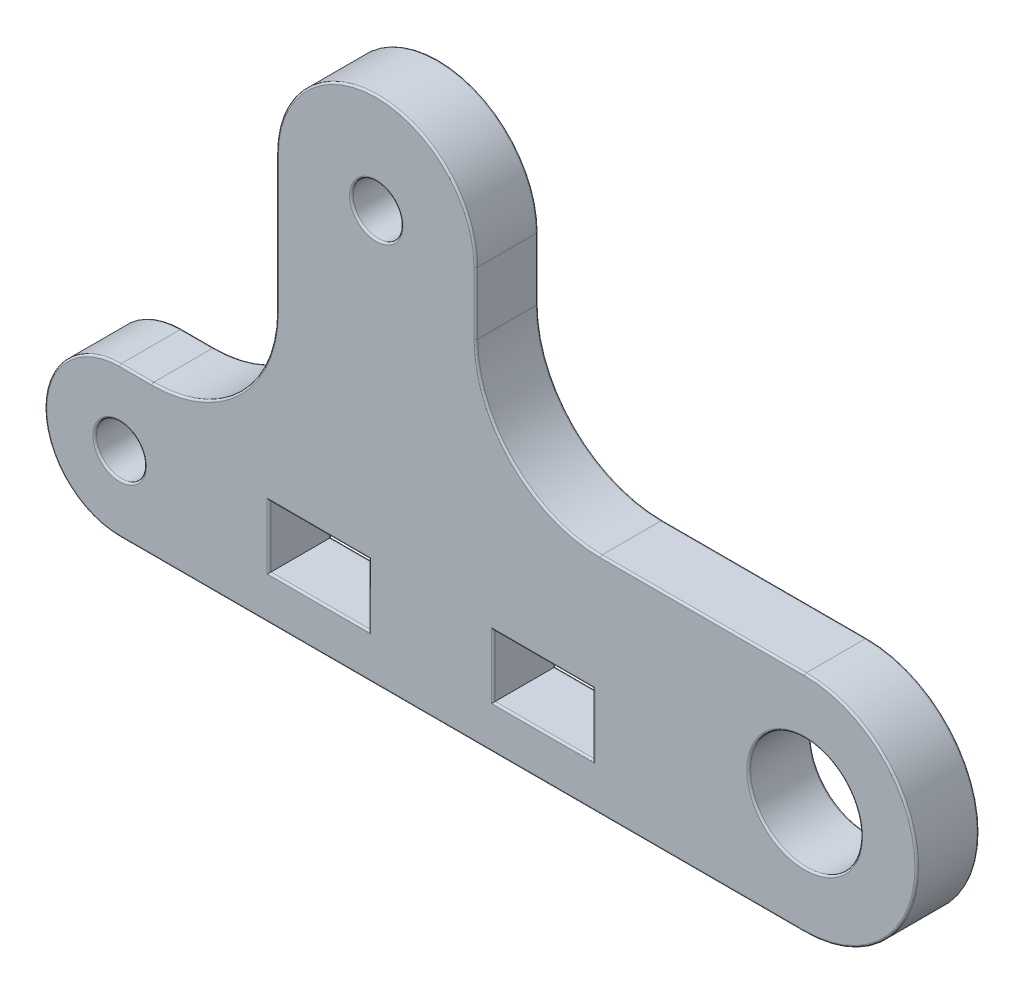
from build123d import *

# Parameters (mm, degrees)
SKETCH1_R           = 2
SKETCH1_R_2         = 4.5
SKETCH1_W           = 8
SKETCH1_H           = 5
BOSS_EXTRUDE1_DEPTH = 2.5
FILLET1_R           = 0.15


with BuildPart() as part:
    # Sketch1 → Boss-Extrude1 (new, symmetric)
    with BuildSketch(Plane.XY):
        with BuildLine():
            Line((-27.5, 0), (27.5, 0))
            ThreePointArc((27.5, 0), (36.5, 9), (27.5, 18))
            Line((27.5, 18), (11.1, 18))
            ThreePointArc((11.1, 18), (4.028932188, 20.928932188), (1.1, 28))
            Line((1.1, 28), (1.1, 33))
            ThreePointArc((1.1, 33), (-6.9, 41), (-14.9, 33))
            Line((-14.9, 33), (-14.9, 22))
            ThreePointArc((-14.9, 22), (-17.828932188, 14.928932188), (-24.9, 12))
            Line((-24.9, 12), (-27.5, 12))
            ThreePointArc((-27.5, 12), (-33.5, 6), (-27.5, 0))
        make_face()
        with Locations((-27.5, 6)):
            Circle(SKETCH1_R, mode=Mode.SUBTRACT)
        with Locations((27.5, 9)):
            Circle(SKETCH1_R_2, mode=Mode.SUBTRACT)
        with Locations((-6.9, 33)):
            Circle(SKETCH1_R, mode=Mode.SUBTRACT)
        with Locations((-11.5, 6)):
            Rectangle(SKETCH1_W, SKETCH1_H, mode=Mode.SUBTRACT)
        with Locations((6.5, 6)):
            Rectangle(SKETCH1_W, SKETCH1_H, mode=Mode.SUBTRACT)
    extrude(amount=BOSS_EXTRUDE1_DEPTH, both=True)

    # Fillet1
    fillet1_edges = [part.edges().sort_by_distance(p)[0] for p in [
        (36.5, 9, 2.5),
        (-14.9, 27.5, -2.5),
        (-6.9, 41, -2.5),
        (1.1, 30.5, -2.5),
        (4.028932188, 20.928932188, -2.5),
        (19.3, 18, -2.5),
        (36.5, 9, -2.5),
        (0, 0, -2.5),
        (-33.5, 6, -2.5),
        (19.3, 18, 2.5),
        (4.028932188, 20.928932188, 2.5),
        (1.1, 30.5, 2.5),
        (-6.9, 41, 2.5),
        (-14.9, 27.5, 2.5),
        (23, 9, -2.5),
        (23, 9, 2.5),
        (-17.828932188, 14.928932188, 2.5),
        (-29.5, 6, -2.5),
        (-29.5, 6, 2.5),
        (-26.2, 12, 2.5),
        (-8.9, 33, -2.5),
        (-8.9, 33, 2.5),
        (-15.5, 6, -2.5),
        (-11.5, 3.5, -2.5),
        (-33.5, 6, 2.5),
        (-7.5, 6, -2.5),
        (-11.5, 8.5, -2.5),
        (-15.5, 6, 2.5),
        (-11.5, 3.5, 2.5),
        (-7.5, 6, 2.5),
        (-11.5, 8.5, 2.5),
        (2.5, 6, -2.5),
        (6.5, 3.5, -2.5),
        (10.5, 6, -2.5),
        (6.5, 8.5, -2.5),
        (2.5, 6, 2.5),
        (6.5, 3.5, 2.5),
        (10.5, 6, 2.5),
        (6.5, 8.5, 2.5),
        (0, 0, 2.5),
        (-26.2, 12, -2.5),
        (-17.828932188, 14.928932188, -2.5),
    ]]
    fillet(fillet1_edges, radius=FILLET1_R)


solid = part.part
